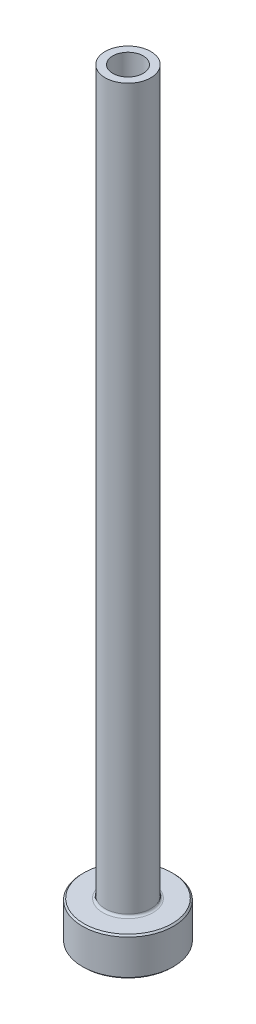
ISO-10303-21;
HEADER;
FILE_DESCRIPTION(('STEP AP214'),'2;1');
FILE_NAME('part.step','',(''),(''),'','','');
FILE_SCHEMA(('AUTOMOTIVE_DESIGN { 1 0 10303 214 1 1 1 1 }'));
ENDSEC;
DATA;
#1=APPLICATION_CONTEXT('core data for automotive mechanical design processes');
#2=APPLICATION_PROTOCOL_DEFINITION('international standard','automotive_design',2000,#1);
#3=PRODUCT_CONTEXT('',#1,'mechanical');
#4=PRODUCT('Part','Part','',(#3));
#5=PRODUCT_RELATED_PRODUCT_CATEGORY('part','',(#4));
#6=PRODUCT_DEFINITION_FORMATION('','',#4);
#7=PRODUCT_DEFINITION_CONTEXT('part definition',#1,'design');
#8=PRODUCT_DEFINITION('design','',#6,#7);
#9=PRODUCT_DEFINITION_SHAPE('','',#8);
#10=(LENGTH_UNIT() NAMED_UNIT(*) SI_UNIT(.MILLI.,.METRE.));
#11=(NAMED_UNIT(*) PLANE_ANGLE_UNIT() SI_UNIT($,.RADIAN.));
#12=(NAMED_UNIT(*) SI_UNIT($,.STERADIAN.) SOLID_ANGLE_UNIT());
#13=UNCERTAINTY_MEASURE_WITH_UNIT(LENGTH_MEASURE(1.E-05),#10,'distance_accuracy_value','');
#14=(GEOMETRIC_REPRESENTATION_CONTEXT(3) GLOBAL_UNCERTAINTY_ASSIGNED_CONTEXT((#13)) GLOBAL_UNIT_ASSIGNED_CONTEXT((#10,
#11,#12)) REPRESENTATION_CONTEXT('',''));
#15=CARTESIAN_POINT('',(0.,0.,0.));
#16=DIRECTION('',(0.,0.,1.));
#17=DIRECTION('',(1.,0.,0.));
#18=AXIS2_PLACEMENT_3D('',#15,#16,#17);
#19=CARTESIAN_POINT('',(0.,92.1876809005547,0.));
#20=DIRECTION('',(0.,1.,0.));
#21=DIRECTION('',(0.,0.,1.));
#22=AXIS2_PLACEMENT_3D('',#19,#20,#21);
#23=CYLINDRICAL_SURFACE('',#22,1.99999999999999);
#24=CARTESIAN_POINT('',(0.,100.,0.));
#25=DIRECTION('',(0.,1.,0.));
#26=DIRECTION('',(0.,0.,1.));
#27=AXIS2_PLACEMENT_3D('',#24,#25,#26);
#28=CIRCLE('',#27,1.99999999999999);
#29=CARTESIAN_POINT('',(0.,100.,1.99999999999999));
#30=VERTEX_POINT('',#29);
#31=EDGE_CURVE('E62',#30,#30,#28,.T.);
#32=ORIENTED_EDGE('',*,*,#31,.T.);
#33=EDGE_LOOP('',(#32));
#34=FACE_BOUND('',#33,.T.);
#35=CARTESIAN_POINT('',(0.,55.,0.));
#36=DIRECTION('',(0.,1.,0.));
#37=DIRECTION('',(0.,0.,1.));
#38=AXIS2_PLACEMENT_3D('',#35,#36,#37);
#39=CIRCLE('',#38,1.99999999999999);
#40=CARTESIAN_POINT('',(0.,55.,1.99999999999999));
#41=VERTEX_POINT('',#40);
#42=EDGE_CURVE('E71',#41,#41,#39,.T.);
#43=ORIENTED_EDGE('',*,*,#42,.F.);
#44=EDGE_LOOP('',(#43));
#45=FACE_BOUND('',#44,.T.);
#46=ADVANCED_FACE('F30',(#34,#45),#23,.F.);
#47=CARTESIAN_POINT('',(-1.99999999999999,100.,0.));
#48=DIRECTION('',(0.,1.,0.));
#49=DIRECTION('',(0.,0.,1.));
#50=AXIS2_PLACEMENT_3D('',#47,#48,#49);
#51=PLANE('',#50);
#52=CARTESIAN_POINT('',(0.,100.,0.));
#53=DIRECTION('',(0.,1.,0.));
#54=DIRECTION('',(0.,0.,1.));
#55=AXIS2_PLACEMENT_3D('',#52,#53,#54);
#56=CIRCLE('',#55,3.);
#57=CARTESIAN_POINT('',(0.,100.,3.));
#58=VERTEX_POINT('',#57);
#59=EDGE_CURVE('E65',#58,#58,#56,.T.);
#60=ORIENTED_EDGE('',*,*,#59,.T.);
#61=EDGE_LOOP('',(#60));
#62=FACE_BOUND('',#61,.T.);
#63=ORIENTED_EDGE('',*,*,#31,.F.);
#64=EDGE_LOOP('',(#63));
#65=FACE_BOUND('',#64,.T.);
#66=ADVANCED_FACE('F79',(#62,#65),#51,.T.);
#67=CARTESIAN_POINT('',(0.,92.1876809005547,0.));
#68=DIRECTION('',(0.,1.,0.));
#69=DIRECTION('',(0.,0.,1.));
#70=AXIS2_PLACEMENT_3D('',#67,#68,#69);
#71=CYLINDRICAL_SURFACE('',#70,3.);
#72=CARTESIAN_POINT('',(0.,5.3,0.));
#73=DIRECTION('',(0.,1.,0.));
#74=DIRECTION('',(0.,0.,1.));
#75=AXIS2_PLACEMENT_3D('',#72,#73,#74);
#76=CIRCLE('',#75,3.);
#77=CARTESIAN_POINT('',(0.,5.3,3.));
#78=VERTEX_POINT('',#77);
#79=EDGE_CURVE('E59',#78,#78,#76,.T.);
#80=ORIENTED_EDGE('',*,*,#79,.T.);
#81=EDGE_LOOP('',(#80));
#82=FACE_BOUND('',#81,.T.);
#83=ORIENTED_EDGE('',*,*,#59,.F.);
#84=EDGE_LOOP('',(#83));
#85=FACE_BOUND('',#84,.T.);
#86=ADVANCED_FACE('F85',(#82,#85),#71,.T.);
#87=CARTESIAN_POINT('',(-2.99999999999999,5.,0.));
#88=DIRECTION('',(0.,1.,0.));
#89=DIRECTION('',(0.,0.,1.));
#90=AXIS2_PLACEMENT_3D('',#87,#88,#89);
#91=PLANE('',#90);
#92=CARTESIAN_POINT('',(0.,5.,0.));
#93=DIRECTION('',(0.,1.,0.));
#94=DIRECTION('',(0.,0.,1.));
#95=AXIS2_PLACEMENT_3D('',#92,#93,#94);
#96=CIRCLE('',#95,5.79999999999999);
#97=CARTESIAN_POINT('',(0.,5.,5.79999999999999));
#98=VERTEX_POINT('',#97);
#99=EDGE_CURVE('E53',#98,#98,#96,.T.);
#100=ORIENTED_EDGE('',*,*,#99,.T.);
#101=EDGE_LOOP('',(#100));
#102=FACE_BOUND('',#101,.T.);
#103=CARTESIAN_POINT('',(0.,5.,0.));
#104=DIRECTION('',(0.,1.,0.));
#105=DIRECTION('',(0.,0.,1.));
#106=AXIS2_PLACEMENT_3D('',#103,#104,#105);
#107=CIRCLE('',#106,3.3);
#108=CARTESIAN_POINT('',(0.,5.,3.3));
#109=VERTEX_POINT('',#108);
#110=EDGE_CURVE('E56',#109,#109,#107,.F.);
#111=ORIENTED_EDGE('',*,*,#110,.T.);
#112=EDGE_LOOP('',(#111));
#113=FACE_BOUND('',#112,.T.);
#114=ADVANCED_FACE('F111',(#102,#113),#91,.T.);
#115=CARTESIAN_POINT('',(0.,92.1876809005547,0.));
#116=DIRECTION('',(0.,1.,0.));
#117=DIRECTION('',(0.,0.,1.));
#118=AXIS2_PLACEMENT_3D('',#115,#116,#117);
#119=CYLINDRICAL_SURFACE('',#118,5.99999999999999);
#120=CARTESIAN_POINT('',(0.,4.8,0.));
#121=DIRECTION('',(0.,1.,0.));
#122=DIRECTION('',(0.,0.,1.));
#123=AXIS2_PLACEMENT_3D('',#120,#121,#122);
#124=CIRCLE('',#123,5.99999999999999);
#125=CARTESIAN_POINT('',(0.,4.8,5.99999999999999));
#126=VERTEX_POINT('',#125);
#127=EDGE_CURVE('E45',#126,#126,#124,.F.);
#128=ORIENTED_EDGE('',*,*,#127,.T.);
#129=EDGE_LOOP('',(#128));
#130=FACE_BOUND('',#129,.T.);
#131=CARTESIAN_POINT('',(0.,0.199999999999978,0.));
#132=DIRECTION('',(0.,-1.,0.));
#133=DIRECTION('',(0.,0.,-1.));
#134=AXIS2_PLACEMENT_3D('',#131,#132,#133);
#135=CIRCLE('',#134,5.99999999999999);
#136=CARTESIAN_POINT('',(0.,0.199999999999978,5.99999999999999));
#137=VERTEX_POINT('',#136);
#138=EDGE_CURVE('E50',#137,#137,#135,.F.);
#139=ORIENTED_EDGE('',*,*,#138,.T.);
#140=EDGE_LOOP('',(#139));
#141=FACE_BOUND('',#140,.T.);
#142=ADVANCED_FACE('F108',(#130,#141),#119,.T.);
#143=CARTESIAN_POINT('',(-5.99999999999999,0.,0.));
#144=DIRECTION('',(0.,-1.,0.));
#145=DIRECTION('',(0.,0.,-1.));
#146=AXIS2_PLACEMENT_3D('',#143,#144,#145);
#147=PLANE('',#146);
#148=CARTESIAN_POINT('',(0.,0.,0.));
#149=DIRECTION('',(0.,-1.,0.));
#150=DIRECTION('',(0.,0.,-1.));
#151=AXIS2_PLACEMENT_3D('',#148,#149,#150);
#152=CIRCLE('',#151,2.74999999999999);
#153=CARTESIAN_POINT('',(0.,0.,-2.74999999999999));
#154=VERTEX_POINT('',#153);
#155=EDGE_CURVE('E37',#154,#154,#152,.F.);
#156=ORIENTED_EDGE('',*,*,#155,.T.);
#157=EDGE_LOOP('',(#156));
#158=FACE_BOUND('',#157,.T.);
#159=CARTESIAN_POINT('',(0.,0.,0.));
#160=DIRECTION('',(0.,-1.,0.));
#161=DIRECTION('',(0.,0.,-1.));
#162=AXIS2_PLACEMENT_3D('',#159,#160,#161);
#163=CIRCLE('',#162,5.8);
#164=CARTESIAN_POINT('',(0.,0.,5.8));
#165=VERTEX_POINT('',#164);
#166=EDGE_CURVE('E41',#165,#165,#163,.T.);
#167=ORIENTED_EDGE('',*,*,#166,.T.);
#168=EDGE_LOOP('',(#167));
#169=FACE_BOUND('',#168,.T.);
#170=ADVANCED_FACE('F110',(#158,#169),#147,.T.);
#171=CARTESIAN_POINT('',(0.,92.1876809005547,0.));
#172=DIRECTION('',(0.,1.,0.));
#173=DIRECTION('',(0.,0.,1.));
#174=AXIS2_PLACEMENT_3D('',#171,#172,#173);
#175=CYLINDRICAL_SURFACE('',#174,2.24999999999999);
#176=CARTESIAN_POINT('',(0.,0.5,0.));
#177=DIRECTION('',(0.,-1.,0.));
#178=DIRECTION('',(0.,0.,-1.));
#179=AXIS2_PLACEMENT_3D('',#176,#177,#178);
#180=CIRCLE('',#179,2.24999999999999);
#181=CARTESIAN_POINT('',(0.,0.5,-2.24999999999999));
#182=VERTEX_POINT('',#181);
#183=EDGE_CURVE('E10',#182,#182,#180,.T.);
#184=ORIENTED_EDGE('',*,*,#183,.T.);
#185=EDGE_LOOP('',(#184));
#186=FACE_BOUND('',#185,.T.);
#187=CARTESIAN_POINT('',(0.,43.,0.));
#188=DIRECTION('',(0.,1.,0.));
#189=DIRECTION('',(0.,0.,1.));
#190=AXIS2_PLACEMENT_3D('',#187,#188,#189);
#191=CIRCLE('',#190,2.25);
#192=CARTESIAN_POINT('',(0.,43.,2.25));
#193=VERTEX_POINT('',#192);
#194=EDGE_CURVE('E68',#193,#193,#191,.T.);
#195=ORIENTED_EDGE('',*,*,#194,.T.);
#196=EDGE_LOOP('',(#195));
#197=FACE_BOUND('',#196,.T.);
#198=ADVANCED_FACE('F118',(#186,#197),#175,.F.);
#199=CARTESIAN_POINT('',(0.,43.,0.));
#200=DIRECTION('',(0.,-1.,0.));
#201=DIRECTION('',(0.,0.,-1.));
#202=AXIS2_PLACEMENT_3D('',#199,#200,#201);
#203=CONICAL_SURFACE('',#202,2.25,0.0208303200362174);
#204=ORIENTED_EDGE('',*,*,#42,.T.);
#205=EDGE_LOOP('',(#204));
#206=FACE_BOUND('',#205,.T.);
#207=ORIENTED_EDGE('',*,*,#194,.F.);
#208=EDGE_LOOP('',(#207));
#209=FACE_BOUND('',#208,.T.);
#210=ADVANCED_FACE('F75',(#206,#209),#203,.F.);
#211=CARTESIAN_POINT('',(0.,5.3,0.));
#212=DIRECTION('',(0.,1.,0.));
#213=DIRECTION('',(0.,0.,1.));
#214=AXIS2_PLACEMENT_3D('',#211,#212,#213);
#215=TOROIDAL_SURFACE('',#214,3.3,0.3);
#216=ORIENTED_EDGE('',*,*,#110,.F.);
#217=EDGE_LOOP('',(#216));
#218=FACE_BOUND('',#217,.T.);
#219=ORIENTED_EDGE('',*,*,#79,.F.);
#220=EDGE_LOOP('',(#219));
#221=FACE_BOUND('',#220,.T.);
#222=ADVANCED_FACE('F90',(#218,#221),#215,.F.);
#223=CARTESIAN_POINT('',(0.,5.,0.));
#224=DIRECTION('',(0.,-1.,0.));
#225=DIRECTION('',(0.,0.,-1.));
#226=AXIS2_PLACEMENT_3D('',#223,#224,#225);
#227=CONICAL_SURFACE('',#226,5.79999999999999,0.785398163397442);
#228=ORIENTED_EDGE('',*,*,#127,.F.);
#229=EDGE_LOOP('',(#228));
#230=FACE_BOUND('',#229,.T.);
#231=ORIENTED_EDGE('',*,*,#99,.F.);
#232=EDGE_LOOP('',(#231));
#233=FACE_BOUND('',#232,.T.);
#234=ADVANCED_FACE('F93',(#230,#233),#227,.T.);
#235=CARTESIAN_POINT('',(0.,0.199999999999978,0.));
#236=DIRECTION('',(0.,1.,0.));
#237=DIRECTION('',(0.,0.,1.));
#238=AXIS2_PLACEMENT_3D('',#235,#236,#237);
#239=CONICAL_SURFACE('',#238,5.99999999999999,0.785398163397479);
#240=CARTESIAN_POINT('',(0.,0.,5.8));
#241=CARTESIAN_POINT('',(0.,0.00208333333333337,5.80208333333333));
#242=CARTESIAN_POINT('',(0.,0.00416666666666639,5.80416666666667));
#243=CARTESIAN_POINT('',(0.,0.00833333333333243,5.80833333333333));
#244=CARTESIAN_POINT('',(0.,0.0104166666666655,5.81041666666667));
#245=CARTESIAN_POINT('',(0.,0.0145833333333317,5.81458333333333));
#246=CARTESIAN_POINT('',(0.,0.0166666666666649,5.81666666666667));
#247=CARTESIAN_POINT('',(0.,0.0208333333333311,5.82083333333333));
#248=CARTESIAN_POINT('',(0.,0.0229166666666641,5.82291666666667));
#249=CARTESIAN_POINT('',(0.,0.0270833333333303,5.82708333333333));
#250=CARTESIAN_POINT('',(0.,0.0291666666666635,5.82916666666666));
#251=CARTESIAN_POINT('',(0.,0.0333333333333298,5.83333333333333));
#252=CARTESIAN_POINT('',(0.,0.0354166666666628,5.83541666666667));
#253=CARTESIAN_POINT('',(0.,0.0395833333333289,5.83958333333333));
#254=CARTESIAN_POINT('',(0.,0.041666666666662,5.84166666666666));
#255=CARTESIAN_POINT('',(0.,0.0458333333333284,5.84583333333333));
#256=CARTESIAN_POINT('',(0.,0.0479166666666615,5.84791666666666));
#257=CARTESIAN_POINT('',(0.,0.0520833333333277,5.85208333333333));
#258=CARTESIAN_POINT('',(0.,0.0541666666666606,5.85416666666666));
#259=CARTESIAN_POINT('',(0.,0.0583333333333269,5.85833333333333));
#260=CARTESIAN_POINT('',(0.,0.0604166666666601,5.86041666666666));
#261=CARTESIAN_POINT('',(0.,0.0645833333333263,5.86458333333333));
#262=CARTESIAN_POINT('',(0.,0.0666666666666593,5.86666666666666));
#263=CARTESIAN_POINT('',(0.,0.0708333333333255,5.87083333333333));
#264=CARTESIAN_POINT('',(0.,0.0729166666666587,5.87291666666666));
#265=CARTESIAN_POINT('',(0.,0.0770833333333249,5.87708333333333));
#266=CARTESIAN_POINT('',(0.,0.0791666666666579,5.87916666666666));
#267=CARTESIAN_POINT('',(0.,0.0833333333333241,5.88333333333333));
#268=CARTESIAN_POINT('',(0.,0.0854166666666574,5.88541666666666));
#269=CARTESIAN_POINT('',(0.,0.0895833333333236,5.88958333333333));
#270=CARTESIAN_POINT('',(0.,0.0916666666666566,5.89166666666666));
#271=CARTESIAN_POINT('',(0.,0.0958333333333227,5.89583333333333));
#272=CARTESIAN_POINT('',(0.,0.0979166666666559,5.89791666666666));
#273=CARTESIAN_POINT('',(0.,0.102083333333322,5.90208333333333));
#274=CARTESIAN_POINT('',(0.,0.104166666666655,5.90416666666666));
#275=CARTESIAN_POINT('',(0.,0.108333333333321,5.90833333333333));
#276=CARTESIAN_POINT('',(0.,0.110416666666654,5.91041666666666));
#277=CARTESIAN_POINT('',(0.,0.114583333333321,5.91458333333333));
#278=CARTESIAN_POINT('',(0.,0.116666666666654,5.91666666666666));
#279=CARTESIAN_POINT('',(0.,0.12083333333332,5.92083333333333));
#280=CARTESIAN_POINT('',(0.,0.122916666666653,5.92291666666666));
#281=CARTESIAN_POINT('',(0.,0.127083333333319,5.92708333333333));
#282=CARTESIAN_POINT('',(0.,0.129166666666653,5.92916666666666));
#283=CARTESIAN_POINT('',(0.,0.133333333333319,5.93333333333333));
#284=CARTESIAN_POINT('',(0.,0.135416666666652,5.93541666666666));
#285=CARTESIAN_POINT('',(0.,0.139583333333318,5.93958333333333));
#286=CARTESIAN_POINT('',(0.,0.141666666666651,5.94166666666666));
#287=CARTESIAN_POINT('',(0.,0.145833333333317,5.94583333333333));
#288=CARTESIAN_POINT('',(0.,0.14791666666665,5.94791666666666));
#289=CARTESIAN_POINT('',(0.,0.152083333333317,5.95208333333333));
#290=CARTESIAN_POINT('',(0.,0.15416666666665,5.95416666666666));
#291=CARTESIAN_POINT('',(0.,0.158333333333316,5.95833333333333));
#292=CARTESIAN_POINT('',(0.,0.160416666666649,5.96041666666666));
#293=CARTESIAN_POINT('',(0.,0.164583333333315,5.96458333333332));
#294=CARTESIAN_POINT('',(0.,0.166666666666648,5.96666666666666));
#295=CARTESIAN_POINT('',(0.,0.170833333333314,5.97083333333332));
#296=CARTESIAN_POINT('',(0.,0.172916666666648,5.97291666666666));
#297=CARTESIAN_POINT('',(0.,0.177083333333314,5.97708333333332));
#298=CARTESIAN_POINT('',(0.,0.179166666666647,5.97916666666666));
#299=CARTESIAN_POINT('',(0.,0.183333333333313,5.98333333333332));
#300=CARTESIAN_POINT('',(0.,0.185416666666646,5.98541666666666));
#301=CARTESIAN_POINT('',(0.,0.189583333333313,5.98958333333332));
#302=CARTESIAN_POINT('',(0.,0.191666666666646,5.99166666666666));
#303=CARTESIAN_POINT('',(0.,0.195833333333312,5.99583333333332));
#304=CARTESIAN_POINT('',(0.,0.197916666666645,5.99791666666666));
#305=CARTESIAN_POINT('',(0.,0.199999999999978,5.99999999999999));
#306=B_SPLINE_CURVE_WITH_KNOTS('',3,(#240,#241,#242,#243,#244,#245,#246,#247,#248,#249,#250,
#251,#252,#253,#254,#255,#256,#257,#258,#259,#260,#261,#262,#263,#264,#265,#266,#267,#268,#269,
#270,#271,#272,#273,#274,#275,#276,#277,#278,#279,#280,#281,#282,#283,#284,#285,#286,#287,#288,
#289,#290,#291,#292,#293,#294,#295,#296,#297,#298,#299,#300,#301,#302,#303,#304,#305),
.UNSPECIFIED.,.F.,.F.,(4,2,2,2,2,2,2,2,2,2,2,2,2,2,2,2,2,2,2,2,2,2,2,2,2,2,2,2,2,2,2,2,4),(0.,
0.00883883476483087,0.0176776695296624,0.0265165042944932,0.0353553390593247,0.0441941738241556,
0.0530330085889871,0.0618718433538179,0.0707106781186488,0.0795495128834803,0.0883883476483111,
0.0972271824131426,0.106066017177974,0.114904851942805,0.123743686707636,0.132582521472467,
0.141421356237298,0.150260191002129,0.159099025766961,0.167937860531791,0.176776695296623,
0.185615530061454,0.194454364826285,0.203293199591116,0.212132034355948,0.220970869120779,
0.229809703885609,0.238648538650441,0.247487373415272,0.256326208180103,0.265165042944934,
0.274003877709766,0.282842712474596),.UNSPECIFIED.);
#307=EDGE_CURVE('BSEAM96',#165,#137,#306,.T.);
#308=ORIENTED_EDGE('',*,*,#166,.F.);
#309=ORIENTED_EDGE('',*,*,#138,.F.);
#310=ORIENTED_EDGE('',*,*,#307,.T.);
#311=ORIENTED_EDGE('',*,*,#307,.F.);
#312=EDGE_LOOP('',(#308,#310,#309,#311));
#313=FACE_BOUND('',#312,.T.);
#314=ADVANCED_FACE('F96',(#313),#239,.T.);
#315=CARTESIAN_POINT('',(0.,0.,0.));
#316=DIRECTION('',(0.,-1.,0.));
#317=DIRECTION('',(0.,0.,-1.));
#318=AXIS2_PLACEMENT_3D('',#315,#316,#317);
#319=CONICAL_SURFACE('',#318,2.74999999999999,0.785398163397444);
#320=ORIENTED_EDGE('',*,*,#183,.F.);
#321=EDGE_LOOP('',(#320));
#322=FACE_BOUND('',#321,.T.);
#323=ORIENTED_EDGE('',*,*,#155,.F.);
#324=EDGE_LOOP('',(#323));
#325=FACE_BOUND('',#324,.T.);
#326=ADVANCED_FACE('F32',(#322,#325),#319,.F.);
#327=CLOSED_SHELL('',(#46,#66,#86,#114,#142,#170,#198,#210,#222,#234,#314,#326));
#328=MANIFOLD_SOLID_BREP('B2',#327);
#329=ADVANCED_BREP_SHAPE_REPRESENTATION('',(#18,#328),#14);
#330=SHAPE_DEFINITION_REPRESENTATION(#9,#329);
ENDSEC;
END-ISO-10303-21;
